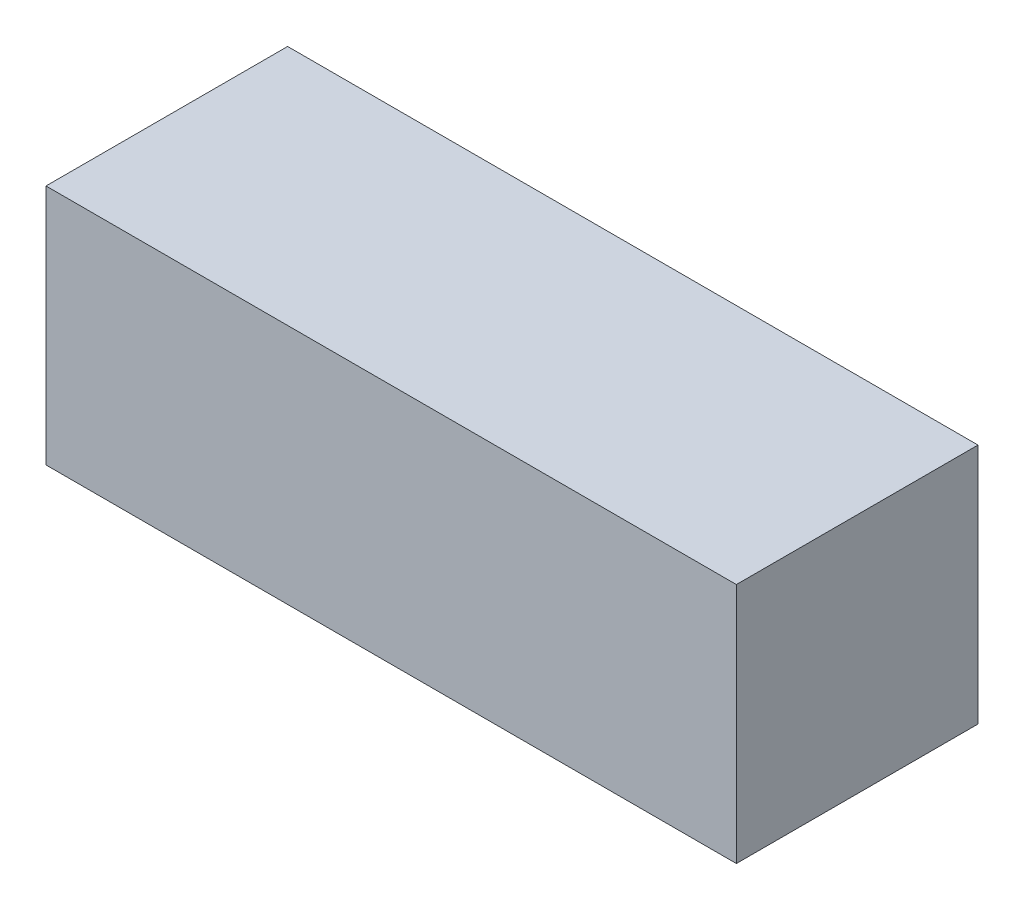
from build123d import *

# Parameters (mm, degrees)
SKETCH1_W           = 200
SKETCH1_H           = 70
BOSS_EXTRUDE1_DEPTH = 70


with BuildPart() as part:
    # Sketch1 → Boss-Extrude1 (new body)
    with BuildSketch(Plane(origin=(0, 0, 0), x_dir=(1, 0, 0), z_dir=(0, 1, 0))):
        with Locations((100, 35)):
            Rectangle(SKETCH1_W, SKETCH1_H)
    extrude(amount=BOSS_EXTRUDE1_DEPTH)


solid = part.part
